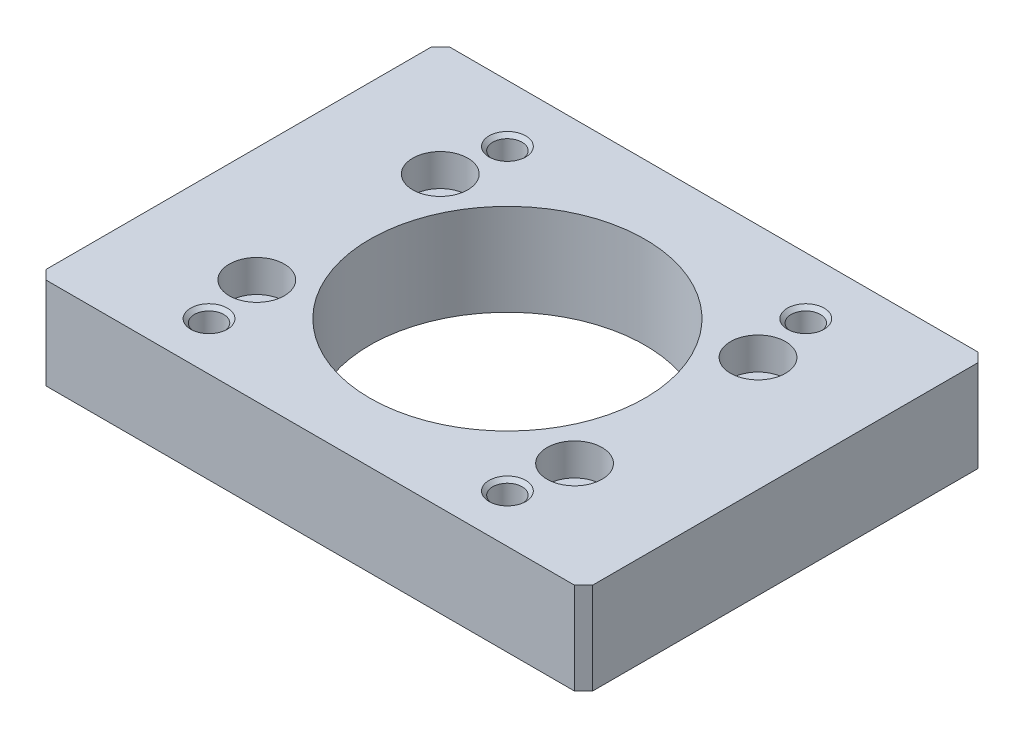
ISO-10303-21;
HEADER;
FILE_DESCRIPTION(('STEP AP214'),'2;1');
FILE_NAME('part.step','',(''),(''),'','','');
FILE_SCHEMA(('AUTOMOTIVE_DESIGN { 1 0 10303 214 1 1 1 1 }'));
ENDSEC;
DATA;
#1=APPLICATION_CONTEXT('core data for automotive mechanical design processes');
#2=APPLICATION_PROTOCOL_DEFINITION('international standard','automotive_design',2000,#1);
#3=PRODUCT_CONTEXT('',#1,'mechanical');
#4=PRODUCT('Part','Part','',(#3));
#5=PRODUCT_RELATED_PRODUCT_CATEGORY('part','',(#4));
#6=PRODUCT_DEFINITION_FORMATION('','',#4);
#7=PRODUCT_DEFINITION_CONTEXT('part definition',#1,'design');
#8=PRODUCT_DEFINITION('design','',#6,#7);
#9=PRODUCT_DEFINITION_SHAPE('','',#8);
#10=(LENGTH_UNIT() NAMED_UNIT(*) SI_UNIT(.MILLI.,.METRE.));
#11=(NAMED_UNIT(*) PLANE_ANGLE_UNIT() SI_UNIT($,.RADIAN.));
#12=(NAMED_UNIT(*) SI_UNIT($,.STERADIAN.) SOLID_ANGLE_UNIT());
#13=UNCERTAINTY_MEASURE_WITH_UNIT(LENGTH_MEASURE(1.E-05),#10,'distance_accuracy_value','');
#14=(GEOMETRIC_REPRESENTATION_CONTEXT(3) GLOBAL_UNCERTAINTY_ASSIGNED_CONTEXT((#13)) GLOBAL_UNIT_ASSIGNED_CONTEXT((#10,
#11,#12)) REPRESENTATION_CONTEXT('',''));
#15=CARTESIAN_POINT('',(0.,0.,0.));
#16=DIRECTION('',(0.,0.,1.));
#17=DIRECTION('',(1.,0.,0.));
#18=AXIS2_PLACEMENT_3D('',#15,#16,#17);
#19=CARTESIAN_POINT('',(-16.26345596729,9.60000000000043,-15.76345596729));
#20=DIRECTION('',(0.,1.,0.));
#21=DIRECTION('',(0.,0.,1.));
#22=AXIS2_PLACEMENT_3D('',#19,#20,#21);
#23=CONICAL_SURFACE('',#22,1.59999999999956,0.785398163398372);
#24=CARTESIAN_POINT('',(-16.26345596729,9.6,-15.76345596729));
#25=DIRECTION('',(0.,1.,0.));
#26=DIRECTION('',(1.,0.,0.));
#27=AXIS2_PLACEMENT_3D('',#24,#25,#26);
#28=CIRCLE('',#27,1.6);
#29=CARTESIAN_POINT('',(-14.66345596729,9.6,-15.76345596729));
#30=VERTEX_POINT('',#29);
#31=EDGE_CURVE('E191',#30,#30,#28,.F.);
#32=ORIENTED_EDGE('',*,*,#31,.T.);
#33=EDGE_LOOP('',(#32));
#34=FACE_BOUND('',#33,.T.);
#35=CARTESIAN_POINT('',(-16.26345596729,10.0000000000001,-15.76345596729));
#36=DIRECTION('',(0.,1.,0.));
#37=DIRECTION('',(0.,0.,1.));
#38=AXIS2_PLACEMENT_3D('',#35,#36,#37);
#39=CIRCLE('',#38,1.99999999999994);
#40=CARTESIAN_POINT('',(-16.26345596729,10.0000000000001,-13.7634559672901));
#41=VERTEX_POINT('',#40);
#42=EDGE_CURVE('E174',#41,#41,#39,.T.);
#43=ORIENTED_EDGE('',*,*,#42,.T.);
#44=EDGE_LOOP('',(#43));
#45=FACE_BOUND('',#44,.T.);
#46=ADVANCED_FACE('F16',(#34,#45),#23,.F.);
#47=CARTESIAN_POINT('',(16.26345596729,9.60000000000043,-15.76345596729));
#48=DIRECTION('',(0.,1.,0.));
#49=DIRECTION('',(0.,0.,1.));
#50=AXIS2_PLACEMENT_3D('',#47,#48,#49);
#51=CONICAL_SURFACE('',#50,1.59999999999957,0.78539816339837);
#52=CARTESIAN_POINT('',(16.26345596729,9.6,-15.76345596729));
#53=DIRECTION('',(0.,1.,0.));
#54=DIRECTION('',(1.,0.,0.));
#55=AXIS2_PLACEMENT_3D('',#52,#53,#54);
#56=CIRCLE('',#55,1.6);
#57=CARTESIAN_POINT('',(17.86345596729,9.6,-15.76345596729));
#58=VERTEX_POINT('',#57);
#59=EDGE_CURVE('E195',#58,#58,#56,.F.);
#60=ORIENTED_EDGE('',*,*,#59,.T.);
#61=EDGE_LOOP('',(#60));
#62=FACE_BOUND('',#61,.T.);
#63=CARTESIAN_POINT('',(16.26345596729,10.0000000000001,-15.76345596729));
#64=DIRECTION('',(0.,1.,0.));
#65=DIRECTION('',(0.,0.,1.));
#66=AXIS2_PLACEMENT_3D('',#63,#64,#65);
#67=CIRCLE('',#66,1.99999999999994);
#68=CARTESIAN_POINT('',(16.26345596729,10.0000000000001,-13.7634559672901));
#69=VERTEX_POINT('',#68);
#70=EDGE_CURVE('E171',#69,#69,#67,.T.);
#71=ORIENTED_EDGE('',*,*,#70,.T.);
#72=EDGE_LOOP('',(#71));
#73=FACE_BOUND('',#72,.T.);
#74=ADVANCED_FACE('F359',(#62,#73),#51,.F.);
#75=CARTESIAN_POINT('',(-16.26345596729,9.60000000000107,16.76345596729));
#76=DIRECTION('',(0.,1.,0.));
#77=DIRECTION('',(0.,0.,1.));
#78=AXIS2_PLACEMENT_3D('',#75,#76,#77);
#79=CONICAL_SURFACE('',#78,1.59999999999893,0.785398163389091);
#80=CARTESIAN_POINT('',(-16.26345596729,9.6,16.76345596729));
#81=DIRECTION('',(0.,1.,0.));
#82=DIRECTION('',(1.,0.,0.));
#83=AXIS2_PLACEMENT_3D('',#80,#81,#82);
#84=CIRCLE('',#83,1.6);
#85=CARTESIAN_POINT('',(-14.66345596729,9.6,16.76345596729));
#86=VERTEX_POINT('',#85);
#87=EDGE_CURVE('E208',#86,#86,#84,.F.);
#88=ORIENTED_EDGE('',*,*,#87,.T.);
#89=EDGE_LOOP('',(#88));
#90=FACE_BOUND('',#89,.T.);
#91=CARTESIAN_POINT('',(-16.26345596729,10.0000000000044,16.76345596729));
#92=DIRECTION('',(0.,1.,0.));
#93=DIRECTION('',(0.,0.,1.));
#94=AXIS2_PLACEMENT_3D('',#91,#92,#93);
#95=CIRCLE('',#94,1.99999999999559);
#96=CARTESIAN_POINT('',(-16.26345596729,10.0000000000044,18.7634559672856));
#97=VERTEX_POINT('',#96);
#98=EDGE_CURVE('E168',#97,#97,#95,.T.);
#99=ORIENTED_EDGE('',*,*,#98,.T.);
#100=EDGE_LOOP('',(#99));
#101=FACE_BOUND('',#100,.T.);
#102=ADVANCED_FACE('F355',(#90,#101),#79,.F.);
#103=CARTESIAN_POINT('',(16.26345596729,9.60000000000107,16.76345596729));
#104=DIRECTION('',(0.,1.,0.));
#105=DIRECTION('',(0.,0.,1.));
#106=AXIS2_PLACEMENT_3D('',#103,#104,#105);
#107=CONICAL_SURFACE('',#106,1.59999999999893,0.785398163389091);
#108=CARTESIAN_POINT('',(16.26345596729,9.6,16.76345596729));
#109=DIRECTION('',(0.,1.,0.));
#110=DIRECTION('',(1.,0.,0.));
#111=AXIS2_PLACEMENT_3D('',#108,#109,#110);
#112=CIRCLE('',#111,1.6);
#113=CARTESIAN_POINT('',(17.86345596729,9.6,16.76345596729));
#114=VERTEX_POINT('',#113);
#115=EDGE_CURVE('E200',#114,#114,#112,.F.);
#116=ORIENTED_EDGE('',*,*,#115,.T.);
#117=EDGE_LOOP('',(#116));
#118=FACE_BOUND('',#117,.T.);
#119=CARTESIAN_POINT('',(16.26345596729,10.0000000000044,16.76345596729));
#120=DIRECTION('',(0.,1.,0.));
#121=DIRECTION('',(0.,0.,1.));
#122=AXIS2_PLACEMENT_3D('',#119,#120,#121);
#123=CIRCLE('',#122,1.99999999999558);
#124=CARTESIAN_POINT('',(16.26345596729,10.0000000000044,18.7634559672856));
#125=VERTEX_POINT('',#124);
#126=EDGE_CURVE('E165',#125,#125,#123,.T.);
#127=ORIENTED_EDGE('',*,*,#126,.T.);
#128=EDGE_LOOP('',(#127));
#129=FACE_BOUND('',#128,.T.);
#130=ADVANCED_FACE('F352',(#118,#129),#107,.F.);
#131=CARTESIAN_POINT('',(17.32050807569,6.5,-9.5));
#132=DIRECTION('',(0.,1.,0.));
#133=DIRECTION('',(0.,0.,1.));
#134=AXIS2_PLACEMENT_3D('',#131,#132,#133);
#135=CYLINDRICAL_SURFACE('',#134,3.);
#136=CARTESIAN_POINT('',(17.32050807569,6.5,-9.5));
#137=DIRECTION('',(0.,1.,0.));
#138=DIRECTION('',(0.,0.,1.));
#139=AXIS2_PLACEMENT_3D('',#136,#137,#138);
#140=CIRCLE('',#139,3.);
#141=CARTESIAN_POINT('',(17.32050807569,6.5,-6.5));
#142=VERTEX_POINT('',#141);
#143=EDGE_CURVE('E20',#142,#142,#140,.F.);
#144=ORIENTED_EDGE('',*,*,#143,.T.);
#145=EDGE_LOOP('',(#144));
#146=FACE_BOUND('',#145,.T.);
#147=CARTESIAN_POINT('',(17.32050807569,10.,-9.5));
#148=DIRECTION('',(0.,1.,0.));
#149=DIRECTION('',(0.,0.,1.));
#150=AXIS2_PLACEMENT_3D('',#147,#148,#149);
#151=CIRCLE('',#150,3.);
#152=CARTESIAN_POINT('',(17.32050807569,10.,-6.5));
#153=VERTEX_POINT('',#152);
#154=EDGE_CURVE('E162',#153,#153,#151,.T.);
#155=ORIENTED_EDGE('',*,*,#154,.T.);
#156=EDGE_LOOP('',(#155));
#157=FACE_BOUND('',#156,.T.);
#158=ADVANCED_FACE('F348',(#146,#157),#135,.F.);
#159=CARTESIAN_POINT('',(-17.32050807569,6.5,-9.5));
#160=DIRECTION('',(0.,1.,0.));
#161=DIRECTION('',(0.,0.,1.));
#162=AXIS2_PLACEMENT_3D('',#159,#160,#161);
#163=CYLINDRICAL_SURFACE('',#162,3.);
#164=CARTESIAN_POINT('',(-17.32050807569,6.5,-9.5));
#165=DIRECTION('',(0.,1.,0.));
#166=DIRECTION('',(0.,0.,1.));
#167=AXIS2_PLACEMENT_3D('',#164,#165,#166);
#168=CIRCLE('',#167,3.);
#169=CARTESIAN_POINT('',(-17.32050807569,6.5,-6.5));
#170=VERTEX_POINT('',#169);
#171=EDGE_CURVE('E184',#170,#170,#168,.F.);
#172=ORIENTED_EDGE('',*,*,#171,.T.);
#173=EDGE_LOOP('',(#172));
#174=FACE_BOUND('',#173,.T.);
#175=CARTESIAN_POINT('',(-17.32050807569,10.,-9.5));
#176=DIRECTION('',(0.,1.,0.));
#177=DIRECTION('',(0.,0.,1.));
#178=AXIS2_PLACEMENT_3D('',#175,#176,#177);
#179=CIRCLE('',#178,3.);
#180=CARTESIAN_POINT('',(-17.32050807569,10.,-6.5));
#181=VERTEX_POINT('',#180);
#182=EDGE_CURVE('E159',#181,#181,#179,.T.);
#183=ORIENTED_EDGE('',*,*,#182,.T.);
#184=EDGE_LOOP('',(#183));
#185=FACE_BOUND('',#184,.T.);
#186=ADVANCED_FACE('F344',(#174,#185),#163,.F.);
#187=CARTESIAN_POINT('',(-17.32050807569,6.5,10.5));
#188=DIRECTION('',(0.,1.,0.));
#189=DIRECTION('',(0.,0.,1.));
#190=AXIS2_PLACEMENT_3D('',#187,#188,#189);
#191=CYLINDRICAL_SURFACE('',#190,3.);
#192=CARTESIAN_POINT('',(-17.32050807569,6.5,10.5));
#193=DIRECTION('',(0.,1.,0.));
#194=DIRECTION('',(0.,0.,1.));
#195=AXIS2_PLACEMENT_3D('',#192,#193,#194);
#196=CIRCLE('',#195,3.);
#197=CARTESIAN_POINT('',(-17.32050807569,6.5,13.5));
#198=VERTEX_POINT('',#197);
#199=EDGE_CURVE('E90',#198,#198,#196,.F.);
#200=ORIENTED_EDGE('',*,*,#199,.T.);
#201=EDGE_LOOP('',(#200));
#202=FACE_BOUND('',#201,.T.);
#203=CARTESIAN_POINT('',(-17.32050807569,10.,10.5));
#204=DIRECTION('',(0.,1.,0.));
#205=DIRECTION('',(0.,0.,1.));
#206=AXIS2_PLACEMENT_3D('',#203,#204,#205);
#207=CIRCLE('',#206,3.);
#208=CARTESIAN_POINT('',(-17.32050807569,10.,13.5));
#209=VERTEX_POINT('',#208);
#210=EDGE_CURVE('E107',#209,#209,#207,.T.);
#211=ORIENTED_EDGE('',*,*,#210,.T.);
#212=EDGE_LOOP('',(#211));
#213=FACE_BOUND('',#212,.T.);
#214=ADVANCED_FACE('F341',(#202,#213),#191,.F.);
#215=CARTESIAN_POINT('',(17.32050807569,6.5,10.5));
#216=DIRECTION('',(0.,1.,0.));
#217=DIRECTION('',(0.,0.,1.));
#218=AXIS2_PLACEMENT_3D('',#215,#216,#217);
#219=CYLINDRICAL_SURFACE('',#218,3.);
#220=CARTESIAN_POINT('',(17.32050807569,6.5,10.5));
#221=DIRECTION('',(0.,1.,0.));
#222=DIRECTION('',(0.,0.,1.));
#223=AXIS2_PLACEMENT_3D('',#220,#221,#222);
#224=CIRCLE('',#223,3.);
#225=CARTESIAN_POINT('',(17.32050807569,6.5,13.5));
#226=VERTEX_POINT('',#225);
#227=EDGE_CURVE('E186',#226,#226,#224,.F.);
#228=ORIENTED_EDGE('',*,*,#227,.T.);
#229=EDGE_LOOP('',(#228));
#230=FACE_BOUND('',#229,.T.);
#231=CARTESIAN_POINT('',(17.32050807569,10.,10.5));
#232=DIRECTION('',(0.,1.,0.));
#233=DIRECTION('',(0.,0.,1.));
#234=AXIS2_PLACEMENT_3D('',#231,#232,#233);
#235=CIRCLE('',#234,3.);
#236=CARTESIAN_POINT('',(17.32050807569,10.,13.5));
#237=VERTEX_POINT('',#236);
#238=EDGE_CURVE('E104',#237,#237,#235,.T.);
#239=ORIENTED_EDGE('',*,*,#238,.T.);
#240=EDGE_LOOP('',(#239));
#241=FACE_BOUND('',#240,.T.);
#242=ADVANCED_FACE('F338',(#230,#241),#219,.F.);
#243=CARTESIAN_POINT('',(-29.86914683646,10.2,-20.93085316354));
#244=DIRECTION('',(-0.707106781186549,0.,-0.707106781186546));
#245=DIRECTION('',(0.707106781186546,0.,-0.707106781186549));
#246=AXIS2_PLACEMENT_3D('',#243,#244,#245);
#247=PLANE('',#246);
#248=DIRECTION('',(0.707106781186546,0.,-0.707106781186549));
#249=VECTOR('',#248,1.);
#250=CARTESIAN_POINT('',(-29.86914683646,10.,-20.93085316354));
#251=LINE('',#250,#249);
#252=CARTESIAN_POINT('',(-29.8,10.,-21.));
#253=VERTEX_POINT('',#252);
#254=CARTESIAN_POINT('',(-28.8,10.,-22.));
#255=VERTEX_POINT('',#254);
#256=EDGE_CURVE('E177',#253,#255,#251,.T.);
#257=ORIENTED_EDGE('',*,*,#256,.T.);
#258=DIRECTION('',(0.,1.,0.));
#259=VECTOR('',#258,1.);
#260=CARTESIAN_POINT('',(-28.8,5.,-22.));
#261=LINE('',#260,#259);
#262=CARTESIAN_POINT('',(-28.8,0.,-22.));
#263=VERTEX_POINT('',#262);
#264=EDGE_CURVE('E100',#255,#263,#261,.F.);
#265=ORIENTED_EDGE('',*,*,#264,.T.);
#266=DIRECTION('',(-0.707106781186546,0.,0.707106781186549));
#267=VECTOR('',#266,1.);
#268=CARTESIAN_POINT('',(-29.3,0.,-21.5));
#269=LINE('',#268,#267);
#270=CARTESIAN_POINT('',(-29.8,0.,-21.));
#271=VERTEX_POINT('',#270);
#272=EDGE_CURVE('E203',#271,#263,#269,.F.);
#273=ORIENTED_EDGE('',*,*,#272,.F.);
#274=DIRECTION('',(0.,-1.,0.));
#275=VECTOR('',#274,1.);
#276=CARTESIAN_POINT('',(-29.8,5.,-21.));
#277=LINE('',#276,#275);
#278=EDGE_CURVE('E215',#271,#253,#277,.F.);
#279=ORIENTED_EDGE('',*,*,#278,.T.);
#280=EDGE_LOOP('',(#257,#265,#273,#279));
#281=FACE_BOUND('',#280,.T.);
#282=ADVANCED_FACE('F261',(#281),#247,.T.);
#283=CARTESIAN_POINT('',(-28.73085316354,10.2,22.06914683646));
#284=DIRECTION('',(-0.707106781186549,0.,0.707106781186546));
#285=DIRECTION('',(-0.707106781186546,0.,-0.707106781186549));
#286=AXIS2_PLACEMENT_3D('',#283,#284,#285);
#287=PLANE('',#286);
#288=DIRECTION('',(-0.707106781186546,0.,-0.707106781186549));
#289=VECTOR('',#288,1.);
#290=CARTESIAN_POINT('',(-28.73085316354,10.,22.06914683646));
#291=LINE('',#290,#289);
#292=CARTESIAN_POINT('',(-28.8,10.,22.));
#293=VERTEX_POINT('',#292);
#294=CARTESIAN_POINT('',(-29.8,10.,21.));
#295=VERTEX_POINT('',#294);
#296=EDGE_CURVE('E179',#293,#295,#291,.T.);
#297=ORIENTED_EDGE('',*,*,#296,.T.);
#298=DIRECTION('',(0.,1.,0.));
#299=VECTOR('',#298,1.);
#300=CARTESIAN_POINT('',(-29.8,5.,21.));
#301=LINE('',#300,#299);
#302=CARTESIAN_POINT('',(-29.8,0.,21.));
#303=VERTEX_POINT('',#302);
#304=EDGE_CURVE('E214',#295,#303,#301,.F.);
#305=ORIENTED_EDGE('',*,*,#304,.T.);
#306=DIRECTION('',(0.707106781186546,0.,0.707106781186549));
#307=VECTOR('',#306,1.);
#308=CARTESIAN_POINT('',(-29.3,0.,21.5));
#309=LINE('',#308,#307);
#310=CARTESIAN_POINT('',(-28.8,0.,22.));
#311=VERTEX_POINT('',#310);
#312=EDGE_CURVE('E257',#311,#303,#309,.F.);
#313=ORIENTED_EDGE('',*,*,#312,.F.);
#314=DIRECTION('',(0.,-1.,0.));
#315=VECTOR('',#314,1.);
#316=CARTESIAN_POINT('',(-28.8,5.,22.));
#317=LINE('',#316,#315);
#318=EDGE_CURVE('E222',#311,#293,#317,.F.);
#319=ORIENTED_EDGE('',*,*,#318,.T.);
#320=EDGE_LOOP('',(#297,#305,#313,#319));
#321=FACE_BOUND('',#320,.T.);
#322=ADVANCED_FACE('F267',(#321),#287,.T.);
#323=CARTESIAN_POINT('',(28.73085316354,10.2,-22.06914683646));
#324=DIRECTION('',(0.707106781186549,0.,-0.707106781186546));
#325=DIRECTION('',(0.707106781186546,0.,0.707106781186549));
#326=AXIS2_PLACEMENT_3D('',#323,#324,#325);
#327=PLANE('',#326);
#328=DIRECTION('',(0.707106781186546,0.,0.707106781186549));
#329=VECTOR('',#328,1.);
#330=CARTESIAN_POINT('',(28.73085316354,10.,-22.06914683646));
#331=LINE('',#330,#329);
#332=CARTESIAN_POINT('',(28.8,10.,-22.));
#333=VERTEX_POINT('',#332);
#334=CARTESIAN_POINT('',(29.8,10.,-21.));
#335=VERTEX_POINT('',#334);
#336=EDGE_CURVE('E80',#333,#335,#331,.T.);
#337=ORIENTED_EDGE('',*,*,#336,.T.);
#338=DIRECTION('',(0.,1.,0.));
#339=VECTOR('',#338,1.);
#340=CARTESIAN_POINT('',(29.8,5.,-21.));
#341=LINE('',#340,#339);
#342=CARTESIAN_POINT('',(29.8,0.,-21.));
#343=VERTEX_POINT('',#342);
#344=EDGE_CURVE('E113',#335,#343,#341,.F.);
#345=ORIENTED_EDGE('',*,*,#344,.T.);
#346=DIRECTION('',(-0.707106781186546,0.,-0.707106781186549));
#347=VECTOR('',#346,1.);
#348=CARTESIAN_POINT('',(29.3,0.,-21.5));
#349=LINE('',#348,#347);
#350=CARTESIAN_POINT('',(28.8,0.,-22.));
#351=VERTEX_POINT('',#350);
#352=EDGE_CURVE('E103',#351,#343,#349,.F.);
#353=ORIENTED_EDGE('',*,*,#352,.F.);
#354=DIRECTION('',(0.,-1.,0.));
#355=VECTOR('',#354,1.);
#356=CARTESIAN_POINT('',(28.8,5.,-22.));
#357=LINE('',#356,#355);
#358=EDGE_CURVE('E97',#351,#333,#357,.F.);
#359=ORIENTED_EDGE('',*,*,#358,.T.);
#360=EDGE_LOOP('',(#337,#345,#353,#359));
#361=FACE_BOUND('',#360,.T.);
#362=ADVANCED_FACE('F102',(#361),#327,.T.);
#363=CARTESIAN_POINT('',(29.86914683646,10.2,20.93085316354));
#364=DIRECTION('',(0.707106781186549,0.,0.707106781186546));
#365=DIRECTION('',(-0.707106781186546,0.,0.707106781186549));
#366=AXIS2_PLACEMENT_3D('',#363,#364,#365);
#367=PLANE('',#366);
#368=DIRECTION('',(-0.707106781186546,0.,0.707106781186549));
#369=VECTOR('',#368,1.);
#370=CARTESIAN_POINT('',(29.86914683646,10.,20.93085316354));
#371=LINE('',#370,#369);
#372=CARTESIAN_POINT('',(29.8,10.,21.));
#373=VERTEX_POINT('',#372);
#374=CARTESIAN_POINT('',(28.8,10.,22.));
#375=VERTEX_POINT('',#374);
#376=EDGE_CURVE('E89',#373,#375,#371,.T.);
#377=ORIENTED_EDGE('',*,*,#376,.T.);
#378=DIRECTION('',(0.,1.,0.));
#379=VECTOR('',#378,1.);
#380=CARTESIAN_POINT('',(28.8,5.,22.));
#381=LINE('',#380,#379);
#382=CARTESIAN_POINT('',(28.8,0.,22.));
#383=VERTEX_POINT('',#382);
#384=EDGE_CURVE('E111',#375,#383,#381,.F.);
#385=ORIENTED_EDGE('',*,*,#384,.T.);
#386=DIRECTION('',(0.707106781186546,0.,-0.707106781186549));
#387=VECTOR('',#386,1.);
#388=CARTESIAN_POINT('',(29.3,0.,21.5));
#389=LINE('',#388,#387);
#390=CARTESIAN_POINT('',(29.8,0.,21.));
#391=VERTEX_POINT('',#390);
#392=EDGE_CURVE('E35',#391,#383,#389,.F.);
#393=ORIENTED_EDGE('',*,*,#392,.F.);
#394=DIRECTION('',(0.,-1.,0.));
#395=VECTOR('',#394,1.);
#396=CARTESIAN_POINT('',(29.8,5.,21.));
#397=LINE('',#396,#395);
#398=EDGE_CURVE('E114',#391,#373,#397,.F.);
#399=ORIENTED_EDGE('',*,*,#398,.T.);
#400=EDGE_LOOP('',(#377,#385,#393,#399));
#401=FACE_BOUND('',#400,.T.);
#402=ADVANCED_FACE('F228',(#401),#367,.T.);
#403=CARTESIAN_POINT('',(-16.26345596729,0.399999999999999,16.76345596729));
#404=DIRECTION('',(0.,1.,0.));
#405=DIRECTION('',(0.,0.,1.));
#406=AXIS2_PLACEMENT_3D('',#403,#404,#405);
#407=CYLINDRICAL_SURFACE('',#406,1.6);
#408=CARTESIAN_POINT('',(-16.26345596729,0.399999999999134,16.76345596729));
#409=DIRECTION('',(0.,-1.,0.));
#410=DIRECTION('',(0.,0.,-1.));
#411=AXIS2_PLACEMENT_3D('',#408,#409,#410);
#412=CIRCLE('',#411,1.59999999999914);
#413=CARTESIAN_POINT('',(-16.26345596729,0.399999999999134,15.1634559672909));
#414=VERTEX_POINT('',#413);
#415=EDGE_CURVE('E227',#414,#414,#412,.T.);
#416=ORIENTED_EDGE('',*,*,#415,.T.);
#417=EDGE_LOOP('',(#416));
#418=FACE_BOUND('',#417,.T.);
#419=ORIENTED_EDGE('',*,*,#87,.F.);
#420=EDGE_LOOP('',(#419));
#421=FACE_BOUND('',#420,.T.);
#422=ADVANCED_FACE('F333',(#418,#421),#407,.F.);
#423=CARTESIAN_POINT('',(16.26345596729,0.399999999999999,16.76345596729));
#424=DIRECTION('',(0.,1.,0.));
#425=DIRECTION('',(0.,0.,1.));
#426=AXIS2_PLACEMENT_3D('',#423,#424,#425);
#427=CYLINDRICAL_SURFACE('',#426,1.6);
#428=CARTESIAN_POINT('',(16.26345596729,0.399999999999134,16.76345596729));
#429=DIRECTION('',(0.,-1.,0.));
#430=DIRECTION('',(0.,0.,-1.));
#431=AXIS2_PLACEMENT_3D('',#428,#429,#430);
#432=CIRCLE('',#431,1.59999999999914);
#433=CARTESIAN_POINT('',(16.26345596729,0.399999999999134,15.1634559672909));
#434=VERTEX_POINT('',#433);
#435=EDGE_CURVE('E251',#434,#434,#432,.T.);
#436=ORIENTED_EDGE('',*,*,#435,.T.);
#437=EDGE_LOOP('',(#436));
#438=FACE_BOUND('',#437,.T.);
#439=ORIENTED_EDGE('',*,*,#115,.F.);
#440=EDGE_LOOP('',(#439));
#441=FACE_BOUND('',#440,.T.);
#442=ADVANCED_FACE('F329',(#438,#441),#427,.F.);
#443=CARTESIAN_POINT('',(16.26345596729,0.399999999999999,-15.76345596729));
#444=DIRECTION('',(0.,1.,0.));
#445=DIRECTION('',(0.,0.,1.));
#446=AXIS2_PLACEMENT_3D('',#443,#444,#445);
#447=CYLINDRICAL_SURFACE('',#446,1.6);
#448=CARTESIAN_POINT('',(16.26345596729,0.399999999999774,-15.76345596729));
#449=DIRECTION('',(0.,-1.,0.));
#450=DIRECTION('',(0.,0.,-1.));
#451=AXIS2_PLACEMENT_3D('',#448,#449,#450);
#452=CIRCLE('',#451,1.59999999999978);
#453=CARTESIAN_POINT('',(16.26345596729,0.399999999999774,-17.3634559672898));
#454=VERTEX_POINT('',#453);
#455=EDGE_CURVE('E248',#454,#454,#452,.T.);
#456=ORIENTED_EDGE('',*,*,#455,.T.);
#457=EDGE_LOOP('',(#456));
#458=FACE_BOUND('',#457,.T.);
#459=ORIENTED_EDGE('',*,*,#59,.F.);
#460=EDGE_LOOP('',(#459));
#461=FACE_BOUND('',#460,.T.);
#462=ADVANCED_FACE('F325',(#458,#461),#447,.F.);
#463=CARTESIAN_POINT('',(-16.26345596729,0.399999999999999,-15.76345596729));
#464=DIRECTION('',(0.,1.,0.));
#465=DIRECTION('',(0.,0.,1.));
#466=AXIS2_PLACEMENT_3D('',#463,#464,#465);
#467=CYLINDRICAL_SURFACE('',#466,1.6);
#468=CARTESIAN_POINT('',(-16.26345596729,0.399999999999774,-15.76345596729));
#469=DIRECTION('',(0.,-1.,0.));
#470=DIRECTION('',(0.,0.,-1.));
#471=AXIS2_PLACEMENT_3D('',#468,#469,#470);
#472=CIRCLE('',#471,1.59999999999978);
#473=CARTESIAN_POINT('',(-16.26345596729,0.399999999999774,-17.3634559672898));
#474=VERTEX_POINT('',#473);
#475=EDGE_CURVE('E155',#474,#474,#472,.T.);
#476=ORIENTED_EDGE('',*,*,#475,.T.);
#477=EDGE_LOOP('',(#476));
#478=FACE_BOUND('',#477,.T.);
#479=ORIENTED_EDGE('',*,*,#31,.F.);
#480=EDGE_LOOP('',(#479));
#481=FACE_BOUND('',#480,.T.);
#482=ADVANCED_FACE('F321',(#478,#481),#467,.F.);
#483=CARTESIAN_POINT('',(-21.13332839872,6.5,14.02650185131));
#484=DIRECTION('',(0.,1.,0.));
#485=DIRECTION('',(1.,0.,0.));
#486=AXIS2_PLACEMENT_3D('',#483,#484,#485);
#487=PLANE('',#486);
#488=CARTESIAN_POINT('',(17.32050807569,6.5,-9.5));
#489=DIRECTION('',(0.,1.,0.));
#490=DIRECTION('',(0.,0.,1.));
#491=AXIS2_PLACEMENT_3D('',#488,#489,#490);
#492=CIRCLE('',#491,1.74999999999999);
#493=CARTESIAN_POINT('',(17.32050807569,6.5,-7.75000000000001));
#494=VERTEX_POINT('',#493);
#495=EDGE_CURVE('E153',#494,#494,#492,.F.);
#496=ORIENTED_EDGE('',*,*,#495,.T.);
#497=EDGE_LOOP('',(#496));
#498=FACE_BOUND('',#497,.T.);
#499=ORIENTED_EDGE('',*,*,#143,.F.);
#500=EDGE_LOOP('',(#499));
#501=FACE_BOUND('',#500,.T.);
#502=ADVANCED_FACE('F324',(#498,#501),#487,.T.);
#503=CARTESIAN_POINT('',(-21.13332839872,6.5,14.02650185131));
#504=DIRECTION('',(0.,1.,0.));
#505=DIRECTION('',(1.,0.,0.));
#506=AXIS2_PLACEMENT_3D('',#503,#504,#505);
#507=PLANE('',#506);
#508=CARTESIAN_POINT('',(17.32050807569,6.5,10.5));
#509=DIRECTION('',(0.,1.,0.));
#510=DIRECTION('',(0.,0.,1.));
#511=AXIS2_PLACEMENT_3D('',#508,#509,#510);
#512=CIRCLE('',#511,1.74999999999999);
#513=CARTESIAN_POINT('',(17.32050807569,6.5,12.25));
#514=VERTEX_POINT('',#513);
#515=EDGE_CURVE('E150',#514,#514,#512,.F.);
#516=ORIENTED_EDGE('',*,*,#515,.T.);
#517=EDGE_LOOP('',(#516));
#518=FACE_BOUND('',#517,.T.);
#519=ORIENTED_EDGE('',*,*,#227,.F.);
#520=EDGE_LOOP('',(#519));
#521=FACE_BOUND('',#520,.T.);
#522=ADVANCED_FACE('F376',(#518,#521),#507,.T.);
#523=CARTESIAN_POINT('',(-21.13332839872,6.5,14.02650185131));
#524=DIRECTION('',(0.,1.,0.));
#525=DIRECTION('',(1.,0.,0.));
#526=AXIS2_PLACEMENT_3D('',#523,#524,#525);
#527=PLANE('',#526);
#528=CARTESIAN_POINT('',(-17.32050807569,6.5,-9.5));
#529=DIRECTION('',(0.,1.,0.));
#530=DIRECTION('',(0.,0.,1.));
#531=AXIS2_PLACEMENT_3D('',#528,#529,#530);
#532=CIRCLE('',#531,1.75);
#533=CARTESIAN_POINT('',(-17.32050807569,6.5,-7.75));
#534=VERTEX_POINT('',#533);
#535=EDGE_CURVE('E147',#534,#534,#532,.F.);
#536=ORIENTED_EDGE('',*,*,#535,.T.);
#537=EDGE_LOOP('',(#536));
#538=FACE_BOUND('',#537,.T.);
#539=ORIENTED_EDGE('',*,*,#171,.F.);
#540=EDGE_LOOP('',(#539));
#541=FACE_BOUND('',#540,.T.);
#542=ADVANCED_FACE('F380',(#538,#541),#527,.T.);
#543=CARTESIAN_POINT('',(-21.13332839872,6.5,14.02650185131));
#544=DIRECTION('',(0.,1.,0.));
#545=DIRECTION('',(1.,0.,0.));
#546=AXIS2_PLACEMENT_3D('',#543,#544,#545);
#547=PLANE('',#546);
#548=CARTESIAN_POINT('',(-17.32050807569,6.5,10.5));
#549=DIRECTION('',(0.,1.,0.));
#550=DIRECTION('',(0.,0.,1.));
#551=AXIS2_PLACEMENT_3D('',#548,#549,#550);
#552=CIRCLE('',#551,1.75);
#553=CARTESIAN_POINT('',(-17.32050807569,6.5,12.25));
#554=VERTEX_POINT('',#553);
#555=EDGE_CURVE('E144',#554,#554,#552,.F.);
#556=ORIENTED_EDGE('',*,*,#555,.T.);
#557=EDGE_LOOP('',(#556));
#558=FACE_BOUND('',#557,.T.);
#559=ORIENTED_EDGE('',*,*,#199,.F.);
#560=EDGE_LOOP('',(#559));
#561=FACE_BOUND('',#560,.T.);
#562=ADVANCED_FACE('F384',(#558,#561),#547,.T.);
#563=CARTESIAN_POINT('',(-30.992,10.,22.88));
#564=DIRECTION('',(0.,1.,0.));
#565=DIRECTION('',(1.,0.,0.));
#566=AXIS2_PLACEMENT_3D('',#563,#564,#565);
#567=PLANE('',#566);
#568=CARTESIAN_POINT('',(0.,10.,0.5));
#569=DIRECTION('',(0.,1.,0.));
#570=DIRECTION('',(0.,0.,1.));
#571=AXIS2_PLACEMENT_3D('',#568,#569,#570);
#572=CIRCLE('',#571,15.);
#573=CARTESIAN_POINT('',(0.,10.,15.5));
#574=VERTEX_POINT('',#573);
#575=EDGE_CURVE('E140',#574,#574,#572,.F.);
#576=ORIENTED_EDGE('',*,*,#575,.T.);
#577=EDGE_LOOP('',(#576));
#578=FACE_BOUND('',#577,.T.);
#579=ORIENTED_EDGE('',*,*,#238,.F.);
#580=EDGE_LOOP('',(#579));
#581=FACE_BOUND('',#580,.T.);
#582=ORIENTED_EDGE('',*,*,#210,.F.);
#583=EDGE_LOOP('',(#582));
#584=FACE_BOUND('',#583,.T.);
#585=ORIENTED_EDGE('',*,*,#182,.F.);
#586=EDGE_LOOP('',(#585));
#587=FACE_BOUND('',#586,.T.);
#588=ORIENTED_EDGE('',*,*,#154,.F.);
#589=EDGE_LOOP('',(#588));
#590=FACE_BOUND('',#589,.T.);
#591=ORIENTED_EDGE('',*,*,#126,.F.);
#592=EDGE_LOOP('',(#591));
#593=FACE_BOUND('',#592,.T.);
#594=ORIENTED_EDGE('',*,*,#98,.F.);
#595=EDGE_LOOP('',(#594));
#596=FACE_BOUND('',#595,.T.);
#597=ORIENTED_EDGE('',*,*,#70,.F.);
#598=EDGE_LOOP('',(#597));
#599=FACE_BOUND('',#598,.T.);
#600=ORIENTED_EDGE('',*,*,#42,.F.);
#601=EDGE_LOOP('',(#600));
#602=FACE_BOUND('',#601,.T.);
#603=ORIENTED_EDGE('',*,*,#256,.F.);
#604=DIRECTION('',(0.,0.,-1.));
#605=VECTOR('',#604,1.);
#606=CARTESIAN_POINT('',(-29.8,9.99999999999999,0.));
#607=LINE('',#606,#605);
#608=EDGE_CURVE('E211',#253,#295,#607,.F.);
#609=ORIENTED_EDGE('',*,*,#608,.T.);
#610=ORIENTED_EDGE('',*,*,#296,.F.);
#611=DIRECTION('',(-1.,0.,0.));
#612=VECTOR('',#611,1.);
#613=CARTESIAN_POINT('',(0.,10.,22.));
#614=LINE('',#613,#612);
#615=EDGE_CURVE('E219',#293,#375,#614,.F.);
#616=ORIENTED_EDGE('',*,*,#615,.T.);
#617=ORIENTED_EDGE('',*,*,#376,.F.);
#618=DIRECTION('',(0.,0.,1.));
#619=VECTOR('',#618,1.);
#620=CARTESIAN_POINT('',(29.8,9.99999999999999,0.));
#621=LINE('',#620,#619);
#622=EDGE_CURVE('E85',#373,#335,#621,.F.);
#623=ORIENTED_EDGE('',*,*,#622,.T.);
#624=ORIENTED_EDGE('',*,*,#336,.F.);
#625=DIRECTION('',(1.,0.,0.));
#626=VECTOR('',#625,1.);
#627=CARTESIAN_POINT('',(0.,10.,-22.));
#628=LINE('',#627,#626);
#629=EDGE_CURVE('E83',#333,#255,#628,.F.);
#630=ORIENTED_EDGE('',*,*,#629,.T.);
#631=EDGE_LOOP('',(#603,#609,#610,#616,#617,#623,#624,#630));
#632=FACE_BOUND('',#631,.T.);
#633=ADVANCED_FACE('F82',(#578,#581,#584,#587,#590,#593,#596,#599,#602,#632),#567,.T.);
#634=CARTESIAN_POINT('',(29.952,-0.2,-22.));
#635=DIRECTION('',(0.,0.,-1.));
#636=DIRECTION('',(-1.,0.,0.));
#637=AXIS2_PLACEMENT_3D('',#634,#635,#636);
#638=PLANE('',#637);
#639=ORIENTED_EDGE('',*,*,#264,.F.);
#640=ORIENTED_EDGE('',*,*,#629,.F.);
#641=ORIENTED_EDGE('',*,*,#358,.F.);
#642=DIRECTION('',(-1.,0.,0.));
#643=VECTOR('',#642,1.);
#644=CARTESIAN_POINT('',(0.,0.,-22.));
#645=LINE('',#644,#643);
#646=EDGE_CURVE('E143',#351,#263,#645,.T.);
#647=ORIENTED_EDGE('',*,*,#646,.T.);
#648=EDGE_LOOP('',(#639,#640,#641,#647));
#649=FACE_BOUND('',#648,.T.);
#650=ADVANCED_FACE('F95',(#649),#638,.T.);
#651=CARTESIAN_POINT('',(-29.8,-0.2,-21.84));
#652=DIRECTION('',(-1.,0.,0.));
#653=DIRECTION('',(0.,0.,1.));
#654=AXIS2_PLACEMENT_3D('',#651,#652,#653);
#655=PLANE('',#654);
#656=ORIENTED_EDGE('',*,*,#304,.F.);
#657=ORIENTED_EDGE('',*,*,#608,.F.);
#658=ORIENTED_EDGE('',*,*,#278,.F.);
#659=DIRECTION('',(0.,0.,1.));
#660=VECTOR('',#659,1.);
#661=CARTESIAN_POINT('',(-29.8,0.,0.));
#662=LINE('',#661,#660);
#663=EDGE_CURVE('E240',#271,#303,#662,.T.);
#664=ORIENTED_EDGE('',*,*,#663,.T.);
#665=EDGE_LOOP('',(#656,#657,#658,#664));
#666=FACE_BOUND('',#665,.T.);
#667=ADVANCED_FACE('F265',(#666),#655,.T.);
#668=CARTESIAN_POINT('',(-29.952,-0.2,22.));
#669=DIRECTION('',(0.,0.,1.));
#670=DIRECTION('',(1.,0.,0.));
#671=AXIS2_PLACEMENT_3D('',#668,#669,#670);
#672=PLANE('',#671);
#673=ORIENTED_EDGE('',*,*,#384,.F.);
#674=ORIENTED_EDGE('',*,*,#615,.F.);
#675=ORIENTED_EDGE('',*,*,#318,.F.);
#676=DIRECTION('',(1.,0.,0.));
#677=VECTOR('',#676,1.);
#678=CARTESIAN_POINT('',(0.,0.,22.));
#679=LINE('',#678,#677);
#680=EDGE_CURVE('E237',#311,#383,#679,.T.);
#681=ORIENTED_EDGE('',*,*,#680,.T.);
#682=EDGE_LOOP('',(#673,#674,#675,#681));
#683=FACE_BOUND('',#682,.T.);
#684=ADVANCED_FACE('F271',(#683),#672,.T.);
#685=CARTESIAN_POINT('',(29.8,-0.2,21.84));
#686=DIRECTION('',(1.,0.,0.));
#687=DIRECTION('',(0.,0.,-1.));
#688=AXIS2_PLACEMENT_3D('',#685,#686,#687);
#689=PLANE('',#688);
#690=ORIENTED_EDGE('',*,*,#398,.F.);
#691=DIRECTION('',(0.,0.,-1.));
#692=VECTOR('',#691,1.);
#693=CARTESIAN_POINT('',(29.8,0.,0.));
#694=LINE('',#693,#692);
#695=EDGE_CURVE('E139',#391,#343,#694,.T.);
#696=ORIENTED_EDGE('',*,*,#695,.T.);
#697=ORIENTED_EDGE('',*,*,#344,.F.);
#698=ORIENTED_EDGE('',*,*,#622,.F.);
#699=EDGE_LOOP('',(#690,#696,#697,#698));
#700=FACE_BOUND('',#699,.T.);
#701=ADVANCED_FACE('F233',(#700),#689,.T.);
#702=CARTESIAN_POINT('',(-16.26345596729,0.399999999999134,16.76345596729));
#703=DIRECTION('',(0.,-1.,0.));
#704=DIRECTION('',(1.,0.,0.));
#705=AXIS2_PLACEMENT_3D('',#702,#703,#704);
#706=CONICAL_SURFACE('',#705,1.59999999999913,0.785398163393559);
#707=ORIENTED_EDGE('',*,*,#415,.F.);
#708=EDGE_LOOP('',(#707));
#709=FACE_BOUND('',#708,.T.);
#710=CARTESIAN_POINT('',(-16.26345596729,-2.42134871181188E-12,16.76345596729));
#711=DIRECTION('',(0.,-1.,0.));
#712=DIRECTION('',(1.,0.,0.));
#713=AXIS2_PLACEMENT_3D('',#710,#711,#712);
#714=CIRCLE('',#713,1.99999999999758);
#715=CARTESIAN_POINT('',(-14.2634559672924,-2.42138259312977E-12,16.76345596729));
#716=VERTEX_POINT('',#715);
#717=EDGE_CURVE('E136',#716,#716,#714,.T.);
#718=ORIENTED_EDGE('',*,*,#717,.T.);
#719=EDGE_LOOP('',(#718));
#720=FACE_BOUND('',#719,.T.);
#721=ADVANCED_FACE('F279',(#709,#720),#706,.F.);
#722=CARTESIAN_POINT('',(16.26345596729,0.399999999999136,16.76345596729));
#723=DIRECTION('',(0.,-1.,0.));
#724=DIRECTION('',(1.,0.,0.));
#725=AXIS2_PLACEMENT_3D('',#722,#723,#724);
#726=CONICAL_SURFACE('',#725,1.59999999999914,0.785398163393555);
#727=ORIENTED_EDGE('',*,*,#435,.F.);
#728=EDGE_LOOP('',(#727));
#729=FACE_BOUND('',#728,.T.);
#730=CARTESIAN_POINT('',(16.26345596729,-2.42259554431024E-12,16.76345596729));
#731=DIRECTION('',(0.,-1.,0.));
#732=DIRECTION('',(1.,0.,0.));
#733=AXIS2_PLACEMENT_3D('',#730,#731,#732);
#734=CIRCLE('',#733,1.99999999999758);
#735=CARTESIAN_POINT('',(18.2634559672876,-2.42262942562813E-12,16.76345596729));
#736=VERTEX_POINT('',#735);
#737=EDGE_CURVE('E133',#736,#736,#734,.T.);
#738=ORIENTED_EDGE('',*,*,#737,.T.);
#739=EDGE_LOOP('',(#738));
#740=FACE_BOUND('',#739,.T.);
#741=ADVANCED_FACE('F309',(#729,#740),#726,.F.);
#742=CARTESIAN_POINT('',(16.26345596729,0.399999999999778,-15.76345596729));
#743=DIRECTION('',(0.,-1.,0.));
#744=DIRECTION('',(1.,0.,0.));
#745=AXIS2_PLACEMENT_3D('',#742,#743,#744);
#746=CONICAL_SURFACE('',#745,1.59999999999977,0.785398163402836);
#747=ORIENTED_EDGE('',*,*,#455,.F.);
#748=EDGE_LOOP('',(#747));
#749=FACE_BOUND('',#748,.T.);
#750=CARTESIAN_POINT('',(16.26345596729,1.93085564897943E-12,-15.76345596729));
#751=DIRECTION('',(0.,-1.,0.));
#752=DIRECTION('',(0.,0.,-1.));
#753=AXIS2_PLACEMENT_3D('',#750,#751,#752);
#754=CIRCLE('',#753,2.00000000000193);
#755=CARTESIAN_POINT('',(16.26345596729,1.93085564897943E-12,-17.7634559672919));
#756=VERTEX_POINT('',#755);
#757=EDGE_CURVE('E130',#756,#756,#754,.T.);
#758=ORIENTED_EDGE('',*,*,#757,.T.);
#759=EDGE_LOOP('',(#758));
#760=FACE_BOUND('',#759,.T.);
#761=ADVANCED_FACE('F315',(#749,#760),#746,.F.);
#762=CARTESIAN_POINT('',(-16.26345596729,0.399999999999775,-15.76345596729));
#763=DIRECTION('',(0.,-1.,0.));
#764=DIRECTION('',(0.,0.,-1.));
#765=AXIS2_PLACEMENT_3D('',#762,#763,#764);
#766=CONICAL_SURFACE('',#765,1.59999999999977,0.785398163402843);
#767=ORIENTED_EDGE('',*,*,#475,.F.);
#768=EDGE_LOOP('',(#767));
#769=FACE_BOUND('',#768,.T.);
#770=CARTESIAN_POINT('',(-16.26345596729,1.93362036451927E-12,-15.76345596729));
#771=DIRECTION('',(0.,-1.,0.));
#772=DIRECTION('',(1.,0.,0.));
#773=AXIS2_PLACEMENT_3D('',#770,#771,#772);
#774=CIRCLE('',#773,2.00000000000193);
#775=CARTESIAN_POINT('',(-14.2634559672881,1.93358648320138E-12,-15.76345596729));
#776=VERTEX_POINT('',#775);
#777=EDGE_CURVE('E127',#776,#776,#774,.T.);
#778=ORIENTED_EDGE('',*,*,#777,.T.);
#779=EDGE_LOOP('',(#778));
#780=FACE_BOUND('',#779,.T.);
#781=ADVANCED_FACE('F435',(#769,#780),#766,.F.);
#782=CARTESIAN_POINT('',(17.32050807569,0.,-9.5));
#783=DIRECTION('',(0.,1.,0.));
#784=DIRECTION('',(0.,0.,1.));
#785=AXIS2_PLACEMENT_3D('',#782,#783,#784);
#786=CYLINDRICAL_SURFACE('',#785,1.74999999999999);
#787=CARTESIAN_POINT('',(17.32050807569,0.,-9.5));
#788=DIRECTION('',(0.,1.,0.));
#789=DIRECTION('',(0.,0.,1.));
#790=AXIS2_PLACEMENT_3D('',#787,#788,#789);
#791=CIRCLE('',#790,1.74999999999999);
#792=CARTESIAN_POINT('',(17.32050807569,0.,-7.75000000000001));
#793=VERTEX_POINT('',#792);
#794=EDGE_CURVE('E124',#793,#793,#791,.F.);
#795=ORIENTED_EDGE('',*,*,#794,.T.);
#796=EDGE_LOOP('',(#795));
#797=FACE_BOUND('',#796,.T.);
#798=ORIENTED_EDGE('',*,*,#495,.F.);
#799=EDGE_LOOP('',(#798));
#800=FACE_BOUND('',#799,.T.);
#801=ADVANCED_FACE('F444',(#797,#800),#786,.F.);
#802=CARTESIAN_POINT('',(17.32050807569,0.,10.5));
#803=DIRECTION('',(0.,1.,0.));
#804=DIRECTION('',(0.,0.,1.));
#805=AXIS2_PLACEMENT_3D('',#802,#803,#804);
#806=CYLINDRICAL_SURFACE('',#805,1.74999999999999);
#807=CARTESIAN_POINT('',(17.32050807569,0.,10.5));
#808=DIRECTION('',(0.,1.,0.));
#809=DIRECTION('',(0.,0.,1.));
#810=AXIS2_PLACEMENT_3D('',#807,#808,#809);
#811=CIRCLE('',#810,1.74999999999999);
#812=CARTESIAN_POINT('',(17.32050807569,0.,12.25));
#813=VERTEX_POINT('',#812);
#814=EDGE_CURVE('E121',#813,#813,#811,.F.);
#815=ORIENTED_EDGE('',*,*,#814,.T.);
#816=EDGE_LOOP('',(#815));
#817=FACE_BOUND('',#816,.T.);
#818=ORIENTED_EDGE('',*,*,#515,.F.);
#819=EDGE_LOOP('',(#818));
#820=FACE_BOUND('',#819,.T.);
#821=ADVANCED_FACE('F454',(#817,#820),#806,.F.);
#822=CARTESIAN_POINT('',(-17.32050807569,0.,-9.5));
#823=DIRECTION('',(0.,1.,0.));
#824=DIRECTION('',(0.,0.,1.));
#825=AXIS2_PLACEMENT_3D('',#822,#823,#824);
#826=CYLINDRICAL_SURFACE('',#825,1.75);
#827=CARTESIAN_POINT('',(-17.32050807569,0.,-9.5));
#828=DIRECTION('',(0.,1.,0.));
#829=DIRECTION('',(0.,0.,1.));
#830=AXIS2_PLACEMENT_3D('',#827,#828,#829);
#831=CIRCLE('',#830,1.75);
#832=CARTESIAN_POINT('',(-17.32050807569,0.,-7.75));
#833=VERTEX_POINT('',#832);
#834=EDGE_CURVE('E118',#833,#833,#831,.F.);
#835=ORIENTED_EDGE('',*,*,#834,.T.);
#836=EDGE_LOOP('',(#835));
#837=FACE_BOUND('',#836,.T.);
#838=ORIENTED_EDGE('',*,*,#535,.F.);
#839=EDGE_LOOP('',(#838));
#840=FACE_BOUND('',#839,.T.);
#841=ADVANCED_FACE('F464',(#837,#840),#826,.F.);
#842=CARTESIAN_POINT('',(-17.32050807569,0.,10.5));
#843=DIRECTION('',(0.,1.,0.));
#844=DIRECTION('',(0.,0.,1.));
#845=AXIS2_PLACEMENT_3D('',#842,#843,#844);
#846=CYLINDRICAL_SURFACE('',#845,1.75);
#847=CARTESIAN_POINT('',(-17.32050807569,0.,10.5));
#848=DIRECTION('',(0.,1.,0.));
#849=DIRECTION('',(0.,0.,1.));
#850=AXIS2_PLACEMENT_3D('',#847,#848,#849);
#851=CIRCLE('',#850,1.75);
#852=CARTESIAN_POINT('',(-17.32050807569,0.,12.25));
#853=VERTEX_POINT('',#852);
#854=EDGE_CURVE('E26',#853,#853,#851,.F.);
#855=ORIENTED_EDGE('',*,*,#854,.T.);
#856=EDGE_LOOP('',(#855));
#857=FACE_BOUND('',#856,.T.);
#858=ORIENTED_EDGE('',*,*,#555,.F.);
#859=EDGE_LOOP('',(#858));
#860=FACE_BOUND('',#859,.T.);
#861=ADVANCED_FACE('F287',(#857,#860),#846,.F.);
#862=CARTESIAN_POINT('',(0.,0.,0.5));
#863=DIRECTION('',(0.,1.,0.));
#864=DIRECTION('',(0.,0.,1.));
#865=AXIS2_PLACEMENT_3D('',#862,#863,#864);
#866=CYLINDRICAL_SURFACE('',#865,15.);
#867=ORIENTED_EDGE('',*,*,#575,.F.);
#868=EDGE_LOOP('',(#867));
#869=FACE_BOUND('',#868,.T.);
#870=CARTESIAN_POINT('',(0.,0.,0.5));
#871=DIRECTION('',(0.,1.,0.));
#872=DIRECTION('',(0.,0.,1.));
#873=AXIS2_PLACEMENT_3D('',#870,#871,#872);
#874=CIRCLE('',#873,15.);
#875=CARTESIAN_POINT('',(0.,0.,15.5));
#876=VERTEX_POINT('',#875);
#877=EDGE_CURVE('E10',#876,#876,#874,.F.);
#878=ORIENTED_EDGE('',*,*,#877,.T.);
#879=EDGE_LOOP('',(#878));
#880=FACE_BOUND('',#879,.T.);
#881=ADVANCED_FACE('F282',(#869,#880),#866,.F.);
#882=CARTESIAN_POINT('',(-30.992,0.,22.88));
#883=DIRECTION('',(0.,1.,0.));
#884=DIRECTION('',(1.,0.,0.));
#885=AXIS2_PLACEMENT_3D('',#882,#883,#884);
#886=PLANE('',#885);
#887=ORIENTED_EDGE('',*,*,#877,.F.);
#888=EDGE_LOOP('',(#887));
#889=FACE_BOUND('',#888,.T.);
#890=ORIENTED_EDGE('',*,*,#854,.F.);
#891=EDGE_LOOP('',(#890));
#892=FACE_BOUND('',#891,.T.);
#893=ORIENTED_EDGE('',*,*,#834,.F.);
#894=EDGE_LOOP('',(#893));
#895=FACE_BOUND('',#894,.T.);
#896=ORIENTED_EDGE('',*,*,#814,.F.);
#897=EDGE_LOOP('',(#896));
#898=FACE_BOUND('',#897,.T.);
#899=ORIENTED_EDGE('',*,*,#794,.F.);
#900=EDGE_LOOP('',(#899));
#901=FACE_BOUND('',#900,.T.);
#902=ORIENTED_EDGE('',*,*,#777,.F.);
#903=EDGE_LOOP('',(#902));
#904=FACE_BOUND('',#903,.T.);
#905=ORIENTED_EDGE('',*,*,#757,.F.);
#906=EDGE_LOOP('',(#905));
#907=FACE_BOUND('',#906,.T.);
#908=ORIENTED_EDGE('',*,*,#737,.F.);
#909=EDGE_LOOP('',(#908));
#910=FACE_BOUND('',#909,.T.);
#911=ORIENTED_EDGE('',*,*,#717,.F.);
#912=EDGE_LOOP('',(#911));
#913=FACE_BOUND('',#912,.T.);
#914=ORIENTED_EDGE('',*,*,#392,.T.);
#915=ORIENTED_EDGE('',*,*,#680,.F.);
#916=ORIENTED_EDGE('',*,*,#312,.T.);
#917=ORIENTED_EDGE('',*,*,#663,.F.);
#918=ORIENTED_EDGE('',*,*,#272,.T.);
#919=ORIENTED_EDGE('',*,*,#646,.F.);
#920=ORIENTED_EDGE('',*,*,#352,.T.);
#921=ORIENTED_EDGE('',*,*,#695,.F.);
#922=EDGE_LOOP('',(#914,#915,#916,#917,#918,#919,#920,#921));
#923=FACE_BOUND('',#922,.T.);
#924=ADVANCED_FACE('F18',(#889,#892,#895,#898,#901,#904,#907,#910,#913,#923),#886,.F.);
#925=CLOSED_SHELL('',(#46,#74,#102,#130,#158,#186,#214,#242,#282,#322,#362,#402,#422,#442,#462,
#482,#502,#522,#542,#562,#633,#650,#667,#684,#701,#721,#741,#761,#781,#801,#821,#841,#861,#881,#924));
#926=MANIFOLD_SOLID_BREP('B1',#925);
#927=ADVANCED_BREP_SHAPE_REPRESENTATION('',(#18,#926),#14);
#928=SHAPE_DEFINITION_REPRESENTATION(#9,#927);
ENDSEC;
END-ISO-10303-21;
